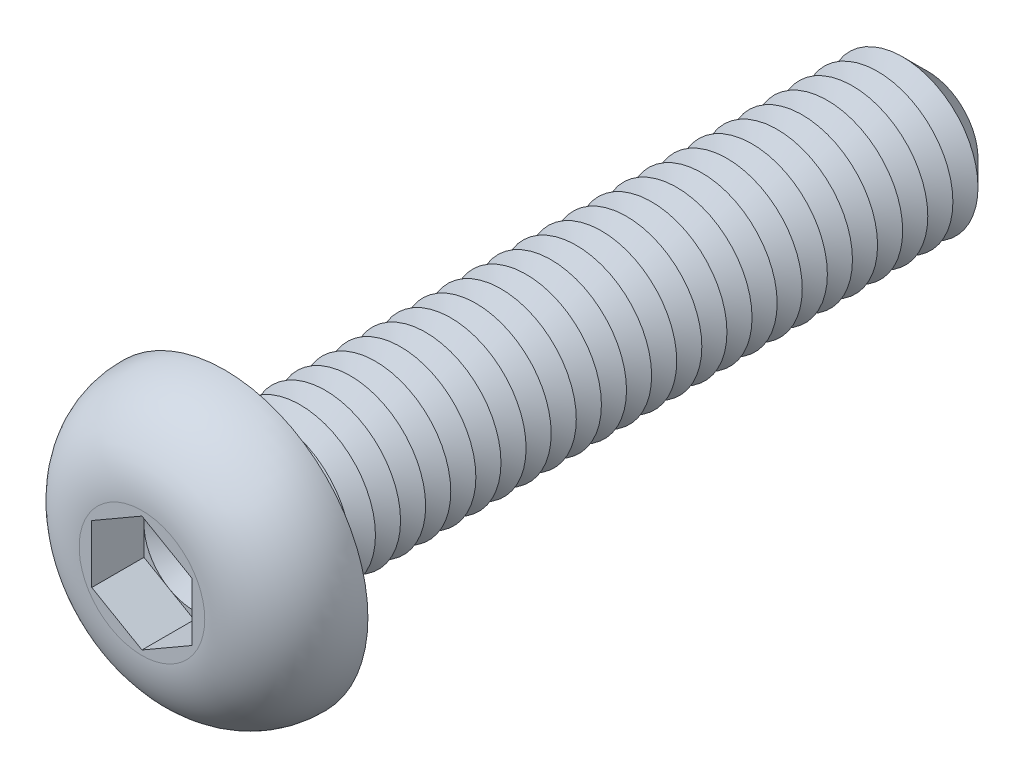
from build123d import *

# Parameters (mm, degrees)
CUT_EXTRUDE1_DEPTH  = 1.04
SKETCH4_R           = 1.5
BOSS_EXTRUDE1_DEPTH = 14
CHAMFER1_SIZE       = 0.5
LPATTERN1_COUNT     = 26
LPATTERN1_PITCH     = 0.5
FILLET2_R           = 0.2


with BuildPart() as part:
    # Sketch2 → Revolve1 (revolve)
    with BuildSketch(Plane(origin=(0, 0, 0), x_dir=(0, 0, -1), z_dir=(1, 0, 0)), mode=Mode.PRIVATE) as revolve1_sk:
        with BuildLine():
            Line((0, 0), (-1.65, 0))
            Line((-1.65, 0), (-1.65, 1.250781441))
            ThreePointArc((-1.65, 1.250781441), (-1.163552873, 2.39969397), (0, 2.85))
            Line((0, 2.85), (0, 0))
        make_face()
    revolve(revolve1_sk.sketch.rotate(Axis((0, 0, 47.934239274), (0, 0, -1)), 90), axis=Axis((0, 0, 47.934239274), (0, 0, -1)))

    # Sketch3 → Cut-Extrude1 (cut)
    with BuildSketch(Plane.XY.offset(1.65)):
        Polygon((0, 1.154700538), (-1, 0.577350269), (-1, -0.577350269), (0, -1.154700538), (1, -0.577350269), (1, 0.577350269), align=None)
    extrude(amount=-CUT_EXTRUDE1_DEPTH, mode=Mode.SUBTRACT)

    # Sketch4 → Boss-Extrude1 (add)
    with BuildSketch(Plane(origin=(0, 0, 0), x_dir=(-1, 0, 0), z_dir=(0, 0, -1))):
        with Locations(Location((0, 0, 0), (0, 0, 180))):
            Circle(SKETCH4_R)
    extrude(amount=BOSS_EXTRUDE1_DEPTH)

    # Chamfer1
    chamfer1_edges = [part.edges().sort_by_distance(p)[0] for p in [
        (-1.5, 0, -14),
    ]]
    chamfer(chamfer1_edges, length=CHAMFER1_SIZE)

    # Sketch5 → Cut-Revolve1 (revolve, cut)
    with BuildSketch(Plane(origin=(0, 0, 0), x_dir=(0, 0, -1), z_dir=(1, 0, 0)), mode=Mode.PRIVATE) as cut_revolve1_sk:
        Polygon((0.5, 1.5), (1, 1.5), (0.75, 1.066987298), align=None)
    cut_revolve1 = revolve(cut_revolve1_sk.sketch.rotate(Axis((0, 0, 47.934239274), (0, 0, -1)), 90), axis=Axis((0, 0, 47.934239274), (0, 0, -1)), mode=Mode.SUBTRACT)

    # LPattern1: Cut-Revolve1 ×26
    with Locations(*[(0, 0, -i * LPATTERN1_PITCH) for i in range(1, LPATTERN1_COUNT)]):
        add(cut_revolve1, mode=Mode.SUBTRACT)

    # Fillet2
    fillet2_edges = [part.edges().sort_by_distance(p)[0] for p in [
        (-1.5, 0, 0),
    ]]
    fillet(fillet2_edges, radius=FILLET2_R)

    # Cut-Extrude2 cone 1 section (on through the dimple's axis) → Cut-Extrude2 (revolve, cut)
    with BuildSketch(Plane(origin=(0, 0, 0.61), x_dir=(0, -1, 0), z_dir=(1, 0, 0))):
        Polygon((0, 0), (1, 0), (0, 0.577350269), align=None)
    revolve(axis=Axis((0, 0, 0.61), (0, 0, -1)), mode=Mode.SUBTRACT)


solid = part.part
